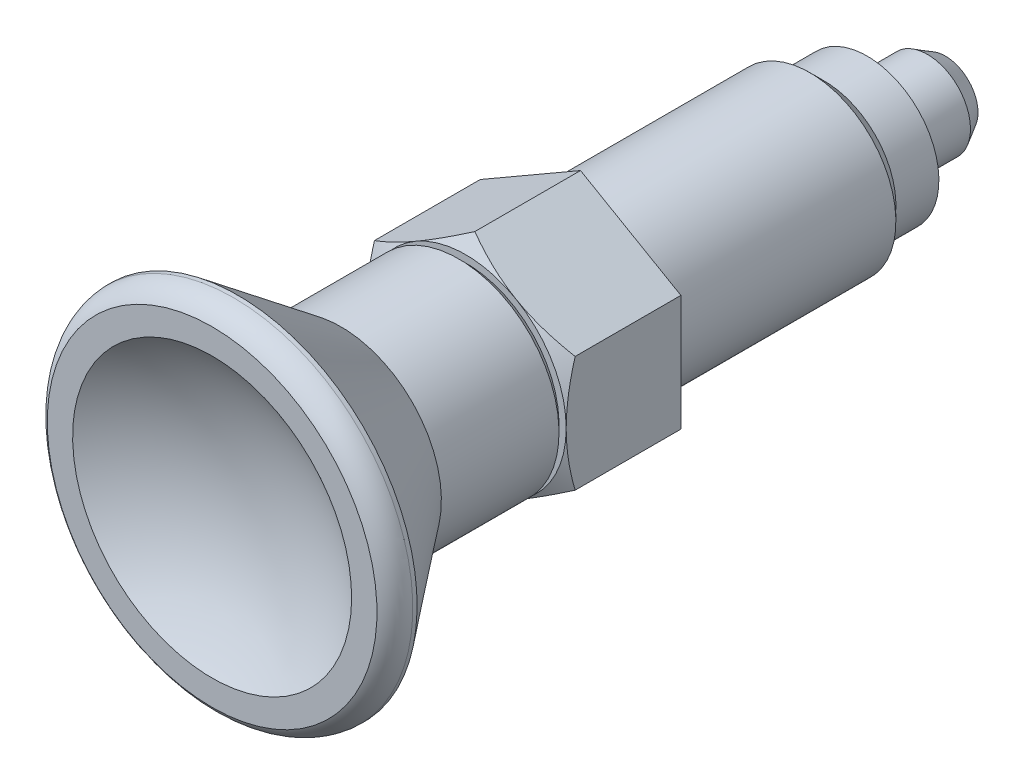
ISO-10303-21;
HEADER;
FILE_DESCRIPTION(('STEP AP214'),'2;1');
FILE_NAME('part.step','',(''),(''),'','','');
FILE_SCHEMA(('AUTOMOTIVE_DESIGN { 1 0 10303 214 1 1 1 1 }'));
ENDSEC;
DATA;
#1=APPLICATION_CONTEXT('core data for automotive mechanical design processes');
#2=APPLICATION_PROTOCOL_DEFINITION('international standard','automotive_design',2000,#1);
#3=PRODUCT_CONTEXT('',#1,'mechanical');
#4=PRODUCT('Part','Part','',(#3));
#5=PRODUCT_RELATED_PRODUCT_CATEGORY('part','',(#4));
#6=PRODUCT_DEFINITION_FORMATION('','',#4);
#7=PRODUCT_DEFINITION_CONTEXT('part definition',#1,'design');
#8=PRODUCT_DEFINITION('design','',#6,#7);
#9=PRODUCT_DEFINITION_SHAPE('','',#8);
#10=(LENGTH_UNIT() NAMED_UNIT(*) SI_UNIT(.MILLI.,.METRE.));
#11=(NAMED_UNIT(*) PLANE_ANGLE_UNIT() SI_UNIT($,.RADIAN.));
#12=(NAMED_UNIT(*) SI_UNIT($,.STERADIAN.) SOLID_ANGLE_UNIT());
#13=UNCERTAINTY_MEASURE_WITH_UNIT(LENGTH_MEASURE(1.E-05),#10,'distance_accuracy_value','');
#14=(GEOMETRIC_REPRESENTATION_CONTEXT(3) GLOBAL_UNCERTAINTY_ASSIGNED_CONTEXT((#13)) GLOBAL_UNIT_ASSIGNED_CONTEXT((#10,
#11,#12)) REPRESENTATION_CONTEXT('',''));
#15=CARTESIAN_POINT('',(0.,0.,0.));
#16=DIRECTION('',(0.,0.,1.));
#17=DIRECTION('',(1.,0.,0.));
#18=AXIS2_PLACEMENT_3D('',#15,#16,#17);
#19=CARTESIAN_POINT('',(0.,0.,38.4));
#20=DIRECTION('',(-1.,0.,0.));
#21=DIRECTION('',(0.,1.,0.));
#22=AXIS2_PLACEMENT_3D('',#19,#20,#21);
#23=SPHERICAL_SURFACE('',#22,16.);
#24=CARTESIAN_POINT('',(0.,9.73190628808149,25.7));
#25=CARTESIAN_POINT('',(-0.273421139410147,9.73190824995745,25.7));
#26=CARTESIAN_POINT('',(-0.546810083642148,9.72037876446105,25.7));
#27=CARTESIAN_POINT('',(-1.091736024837,9.67434130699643,25.7));
#28=CARTESIAN_POINT('',(-1.36327251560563,9.63982728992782,25.7));
#29=CARTESIAN_POINT('',(-1.90275798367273,9.54800856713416,25.7));
#30=CARTESIAN_POINT('',(-2.17070282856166,9.49067960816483,25.7));
#31=CARTESIAN_POINT('',(-2.70081243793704,9.35363887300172,25.7));
#32=CARTESIAN_POINT('',(-2.96297710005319,9.27392670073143,25.7));
#33=CARTESIAN_POINT('',(-3.4795258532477,9.09273210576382,25.7));
#34=CARTESIAN_POINT('',(-3.7339137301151,8.99126047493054,25.7));
#35=CARTESIAN_POINT('',(-4.23323988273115,8.76724349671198,25.7));
#36=CARTESIAN_POINT('',(-4.47817800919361,8.64469781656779,25.7));
#37=CARTESIAN_POINT('',(-4.95679945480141,8.37943799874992,25.7));
#38=CARTESIAN_POINT('',(-5.19048552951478,8.23672883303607,25.7));
#39=CARTESIAN_POINT('',(-5.64500156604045,7.93213690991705,25.7));
#40=CARTESIAN_POINT('',(-5.86583180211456,7.77025456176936,25.7));
#41=CARTESIAN_POINT('',(-6.29309658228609,7.42844474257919,25.7));
#42=CARTESIAN_POINT('',(-6.49952946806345,7.24851519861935,25.7));
#43=CARTESIAN_POINT('',(-6.89650428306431,6.87190546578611,25.7));
#44=CARTESIAN_POINT('',(-7.0870461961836,6.67522525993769,25.7));
#45=CARTESIAN_POINT('',(-7.45089134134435,6.2665046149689,25.7));
#46=CARTESIAN_POINT('',(-7.62419390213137,6.05446357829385,25.7));
#47=CARTESIAN_POINT('',(-7.95231974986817,5.61653562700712,25.7));
#48=CARTESIAN_POINT('',(-8.10714304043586,5.39064871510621,25.7));
#49=CARTESIAN_POINT('',(-8.39720695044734,4.92663927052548,25.7));
#50=CARTESIAN_POINT('',(-8.53244793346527,4.68851696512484,25.7));
#51=CARTESIAN_POINT('',(-8.78238916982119,4.20172578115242,25.7));
#52=CARTESIAN_POINT('',(-8.89708942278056,3.95305690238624,25.7));
#53=CARTESIAN_POINT('',(-9.10513353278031,3.4469409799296,25.7));
#54=CARTESIAN_POINT('',(-9.19847743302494,3.1894939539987,25.7));
#55=CARTESIAN_POINT('',(-9.3631455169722,2.66765155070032,25.7));
#56=CARTESIAN_POINT('',(-9.4344697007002,2.40325617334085,25.7));
#57=CARTESIAN_POINT('',(-9.55459139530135,1.86939624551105,25.7));
#58=CARTESIAN_POINT('',(-9.60338886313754,1.59993168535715,25.7));
#59=CARTESIAN_POINT('',(-9.67811000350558,1.05784961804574,25.7));
#60=CARTESIAN_POINT('',(-9.70403367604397,0.78523211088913,25.7));
#61=CARTESIAN_POINT('',(-9.7328228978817,0.238782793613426,25.7));
#62=CARTESIAN_POINT('',(-9.7356884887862,-0.03504901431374,25.7));
#63=CARTESIAN_POINT('',(-9.71834128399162,-0.581980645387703,25.7));
#64=CARTESIAN_POINT('',(-9.69812848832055,-0.855080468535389,25.7));
#65=CARTESIAN_POINT('',(-9.63476819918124,-1.39860665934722,25.7));
#66=CARTESIAN_POINT('',(-9.59162069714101,-1.66903302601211,25.7));
#67=CARTESIAN_POINT('',(-9.4826977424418,-2.20528963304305,25.7));
#68=CARTESIAN_POINT('',(-9.41692228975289,-2.47111987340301,25.7));
#69=CARTESIAN_POINT('',(-9.263210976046,-2.9962946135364,25.7));
#70=CARTESIAN_POINT('',(-9.17527509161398,-3.25563910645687,25.7));
#71=CARTESIAN_POINT('',(-8.97786812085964,-3.7659982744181,25.7));
#72=CARTESIAN_POINT('',(-8.86839703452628,-4.01701294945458,25.7));
#73=CARTESIAN_POINT('',(-8.62869797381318,-4.50892783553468,25.7));
#74=CARTESIAN_POINT('',(-8.49847000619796,-4.7498280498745,25.7));
#75=CARTESIAN_POINT('',(-8.2181830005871,-5.21980144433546,25.7));
#76=CARTESIAN_POINT('',(-8.06812396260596,-5.44887462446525,25.7));
#77=CARTESIAN_POINT('',(-7.74924171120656,-5.89356528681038,25.7));
#78=CARTESIAN_POINT('',(-7.58041850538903,-6.10918277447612,25.7));
#79=CARTESIAN_POINT('',(-7.22520810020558,-6.52542924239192,25.7));
#80=CARTESIAN_POINT('',(-7.0388209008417,-6.72605822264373,25.7));
#81=CARTESIAN_POINT('',(-6.64980758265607,-7.11090135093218,25.7));
#82=CARTESIAN_POINT('',(-6.44718146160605,-7.2951154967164,25.7));
#83=CARTESIAN_POINT('',(-6.02713087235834,-7.64581927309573,25.7));
#84=CARTESIAN_POINT('',(-5.80970640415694,-7.8123089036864,25.7));
#85=CARTESIAN_POINT('',(-5.36160484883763,-8.12638002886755,25.7));
#86=CARTESIAN_POINT('',(-5.13092775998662,-8.27396152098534,25.7));
#87=CARTESIAN_POINT('',(-4.65796096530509,-8.54916712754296,25.7));
#88=CARTESIAN_POINT('',(-4.41567125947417,-8.67679124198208,25.7));
#89=CARTESIAN_POINT('',(-3.92120177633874,-8.91117475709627,25.7));
#90=CARTESIAN_POINT('',(-3.66902199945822,-9.01793415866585,25.7));
#91=CARTESIAN_POINT('',(-3.15656521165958,-9.2098292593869,25.7));
#92=CARTESIAN_POINT('',(-2.89628820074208,-9.29496495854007,25.7));
#93=CARTESIAN_POINT('',(-2.36948737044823,-9.44300738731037,25.7));
#94=CARTESIAN_POINT('',(-2.10296355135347,-9.50591411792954,25.7));
#95=CARTESIAN_POINT('',(-1.56556391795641,-9.60905138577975,25.7));
#96=CARTESIAN_POINT('',(-1.29468810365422,-9.64928192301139,25.7));
#97=CARTESIAN_POINT('',(-0.750510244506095,-9.70678078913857,25.7));
#98=CARTESIAN_POINT('',(-0.477208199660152,-9.7240491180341,25.7));
#99=CARTESIAN_POINT('',(0.0698791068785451,-9.7355007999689,25.7));
#100=CARTESIAN_POINT('',(0.343664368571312,-9.72968415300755,25.7));
#101=CARTESIAN_POINT('',(0.88977167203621,-9.69500723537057,25.7));
#102=CARTESIAN_POINT('',(1.16209371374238,-9.66614696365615,25.7));
#103=CARTESIAN_POINT('',(1.70333851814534,-9.58558797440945,25.7));
#104=CARTESIAN_POINT('',(1.97226128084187,-9.53388925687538,25.7));
#105=CARTESIAN_POINT('',(2.5047956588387,-9.40802092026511,25.7));
#106=CARTESIAN_POINT('',(2.76840727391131,-9.33385130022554,25.7));
#107=CARTESIAN_POINT('',(3.28844522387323,-9.16356846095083,25.7));
#108=CARTESIAN_POINT('',(3.54487155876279,-9.06745524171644,25.7));
#109=CARTESIAN_POINT('',(4.04871587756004,-8.85396852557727,25.7));
#110=CARTESIAN_POINT('',(4.29613386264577,-8.73659503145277,25.7));
#111=CARTESIAN_POINT('',(4.78020252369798,-8.48142221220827,25.7));
#112=CARTESIAN_POINT('',(5.01685319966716,-8.34362288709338,25.7));
#113=CARTESIAN_POINT('',(5.47770476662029,-8.04857809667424,25.7));
#114=CARTESIAN_POINT('',(5.70190565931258,-7.89133263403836,25.7));
#115=CARTESIAN_POINT('',(6.13626376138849,-7.55851347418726,25.7));
#116=CARTESIAN_POINT('',(6.34642097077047,-7.38293977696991,25.7));
#117=CARTESIAN_POINT('',(6.75119769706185,-7.01471229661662,25.7));
#118=CARTESIAN_POINT('',(6.94581720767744,-6.82205850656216,25.7));
#119=CARTESIAN_POINT('',(7.31813481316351,-6.42104055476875,25.7));
#120=CARTESIAN_POINT('',(7.49583290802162,-6.21267639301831,25.7));
#121=CARTESIAN_POINT('',(7.83304440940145,-5.78171897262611,25.7));
#122=CARTESIAN_POINT('',(7.9925578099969,-5.55912570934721,25.7));
#123=CARTESIAN_POINT('',(8.29226580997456,-5.10129265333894,25.7));
#124=CARTESIAN_POINT('',(8.43246040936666,-4.86605286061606,25.7));
#125=CARTESIAN_POINT('',(8.69253396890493,-4.38459941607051,25.7));
#126=CARTESIAN_POINT('',(8.81241295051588,-4.13838577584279,25.7));
#127=CARTESIAN_POINT('',(9.03100318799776,-3.63673483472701,25.7));
#128=CARTESIAN_POINT('',(9.1297144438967,-3.38129753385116,25.7));
#129=CARTESIAN_POINT('',(9.3052674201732,-2.86301537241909,25.7));
#130=CARTESIAN_POINT('',(9.38210914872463,-2.60017051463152,25.7));
#131=CARTESIAN_POINT('',(9.51337682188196,-2.0689418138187,25.7));
#132=CARTESIAN_POINT('',(9.56780276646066,-1.80055797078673,25.7));
#133=CARTESIAN_POINT('',(9.65385201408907,-1.26015885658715,25.7));
#134=CARTESIAN_POINT('',(9.68547527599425,-0.988143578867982,25.7));
#135=CARTESIAN_POINT('',(9.72569417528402,-0.442415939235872,25.7));
#136=CARTESIAN_POINT('',(9.73428981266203,-0.168703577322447,25.7));
#137=CARTESIAN_POINT('',(9.72839235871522,0.378471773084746,25.7));
#138=CARTESIAN_POINT('',(9.7138993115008,0.651934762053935,25.7));
#139=CARTESIAN_POINT('',(9.66192760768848,1.19666773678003,25.7));
#140=CARTESIAN_POINT('',(9.62444895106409,1.4679377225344,25.7));
#141=CARTESIAN_POINT('',(9.52677237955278,2.00635667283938,25.7));
#142=CARTESIAN_POINT('',(9.46657441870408,2.27350562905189,25.7));
#143=CARTESIAN_POINT('',(9.32388721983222,2.80178267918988,25.7));
#144=CARTESIAN_POINT('',(9.24139798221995,3.06291077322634,25.7));
#145=CARTESIAN_POINT('',(9.05471294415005,3.5772944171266,25.7));
#146=CARTESIAN_POINT('',(8.95051674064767,3.83054982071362,25.7));
#147=CARTESIAN_POINT('',(8.72115947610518,4.32738249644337,25.7));
#148=CARTESIAN_POINT('',(8.59599841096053,4.57095976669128,25.7));
#149=CARTESIAN_POINT('',(8.32560656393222,5.04669509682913,25.7));
#150=CARTESIAN_POINT('',(8.18037656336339,5.27885360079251,25.7));
#151=CARTESIAN_POINT('',(7.8708757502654,5.73011089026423,25.7));
#152=CARTESIAN_POINT('',(7.70660495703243,5.94920968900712,25.7));
#153=CARTESIAN_POINT('',(7.36021019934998,6.37276584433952,25.7));
#154=CARTESIAN_POINT('',(7.17808828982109,6.57722488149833,25.7));
#155=CARTESIAN_POINT('',(6.79726585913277,6.97008025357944,25.7));
#156=CARTESIAN_POINT('',(6.59856498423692,7.15847624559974,25.7));
#157=CARTESIAN_POINT('',(6.18594941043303,7.51790585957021,25.7));
#158=CARTESIAN_POINT('',(5.97203097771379,7.68893519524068,25.7));
#159=CARTESIAN_POINT('',(5.53054854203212,8.01235979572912,25.7));
#160=CARTESIAN_POINT('',(5.30298475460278,8.16475535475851,25.7));
#161=CARTESIAN_POINT('',(4.8357105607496,8.44990255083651,25.7));
#162=CARTESIAN_POINT('',(4.59599419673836,8.58264442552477,25.7));
#163=CARTESIAN_POINT('',(4.10623086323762,8.82744687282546,25.7));
#164=CARTESIAN_POINT('',(3.85618407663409,8.93950781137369,25.7));
#165=CARTESIAN_POINT('',(3.34780095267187,9.14204631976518,25.7));
#166=CARTESIAN_POINT('',(3.089473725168,9.23254674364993,25.7));
#167=CARTESIAN_POINT('',(2.56620241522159,9.39145195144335,25.7));
#168=CARTESIAN_POINT('',(2.30126009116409,9.45986254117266,25.7));
#169=CARTESIAN_POINT('',(1.69995282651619,9.58836325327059,25.7));
#170=CARTESIAN_POINT('',(1.36222155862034,9.6421462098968,25.7));
#171=CARTESIAN_POINT('',(0.682976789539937,9.71391650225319,25.7));
#172=CARTESIAN_POINT('',(0.341463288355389,9.73190383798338,25.7));
#173=CARTESIAN_POINT('',(0.,9.73190628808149,25.7));
#174=B_SPLINE_CURVE_WITH_KNOTS('',3,(#24,#25,#26,#27,#28,#29,#30,#31,#32,#33,#34,#35,#36,#37,
#38,#39,#40,#41,#42,#43,#44,#45,#46,#47,#48,#49,#50,#51,#52,#53,#54,#55,#56,#57,#58,#59,#60,#61,
#62,#63,#64,#65,#66,#67,#68,#69,#70,#71,#72,#73,#74,#75,#76,#77,#78,#79,#80,#81,#82,#83,#84,#85,
#86,#87,#88,#89,#90,#91,#92,#93,#94,#95,#96,#97,#98,#99,#100,#101,#102,#103,#104,#105,#106,#107,
#108,#109,#110,#111,#112,#113,#114,#115,#116,#117,#118,#119,#120,#121,#122,#123,#124,#125,#126,
#127,#128,#129,#130,#131,#132,#133,#134,#135,#136,#137,#138,#139,#140,#141,#142,#143,#144,#145,
#146,#147,#148,#149,#150,#151,#152,#153,#154,#155,#156,#157,#158,#159,#160,#161,#162,#163,#164,
#165,#166,#167,#168,#169,#170,#171,#172,#173),.UNSPECIFIED.,.T.,.F.,(4,2,2,2,2,2,2,2,2,2,2,2,2,
2,2,2,2,2,2,2,2,2,2,2,2,2,2,2,2,2,2,2,2,2,2,2,2,2,2,2,2,2,2,2,2,2,2,2,2,2,2,2,2,2,2,2,2,2,2,2,2,
2,2,2,2,2,2,2,2,2,2,2,2,2,4),(0.,0.819965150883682,1.64014604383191,2.46120116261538,
3.28227081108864,4.10293417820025,4.92361050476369,5.74408481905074,6.56454162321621,
7.38509277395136,8.20564475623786,9.02622867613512,9.8468124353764,10.6673809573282,
11.4879494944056,12.3085163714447,13.1290832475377,13.9496516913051,14.7702201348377,
15.5907870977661,16.411354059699,17.2319213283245,18.0524885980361,18.8730567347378,
19.6936248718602,20.5141927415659,21.3347606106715,22.1553281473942,22.9758956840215,
23.7964633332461,24.6170309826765,25.4375987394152,26.2581664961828,27.0787342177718,
27.8993019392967,28.7198696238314,29.5404373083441,30.3610049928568,31.1815726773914,
32.0021403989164,32.8227081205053,33.6432758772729,34.4638436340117,35.284411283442,
36.1049789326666,36.9255464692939,37.7461140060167,38.5666818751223,39.3872497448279,
40.2078178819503,41.028386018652,41.8489532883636,42.6695205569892,43.4900875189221,
44.3106544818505,45.1312229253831,45.9517913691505,46.7723582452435,47.5929251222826,
48.41349365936,49.2340621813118,50.054645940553,50.8752298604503,51.6957818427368,
52.516332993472,53.3367897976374,54.1572641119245,54.9779404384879,55.7986038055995,
56.6196734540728,57.4407285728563,58.2609094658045,59.0808746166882,60.1048919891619,
61.1289093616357),.UNSPECIFIED.);
#175=CARTESIAN_POINT('',(0.,9.73190628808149,25.7));
#176=VERTEX_POINT('',#175);
#177=EDGE_CURVE('E19',#176,#176,#174,.T.);
#178=ORIENTED_EDGE('',*,*,#177,.T.);
#179=EDGE_LOOP('',(#178));
#180=FACE_BOUND('',#179,.T.);
#181=ADVANCED_FACE('F14',(#180),#23,.F.);
#182=CARTESIAN_POINT('',(9.73190628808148,0.,25.7));
#183=DIRECTION('',(0.,0.,-1.));
#184=DIRECTION('',(0.,1.,0.));
#185=AXIS2_PLACEMENT_3D('',#182,#183,#184);
#186=PLANE('',#185);
#187=ORIENTED_EDGE('',*,*,#177,.F.);
#188=EDGE_LOOP('',(#187));
#189=FACE_BOUND('',#188,.T.);
#190=CARTESIAN_POINT('',(0.,0.,25.7));
#191=DIRECTION('',(0.,0.,-1.));
#192=DIRECTION('',(0.,1.,0.));
#193=AXIS2_PLACEMENT_3D('',#190,#191,#192);
#194=CIRCLE('',#193,11.5);
#195=CARTESIAN_POINT('',(0.,11.5,25.7));
#196=VERTEX_POINT('',#195);
#197=EDGE_CURVE('E422',#196,#196,#194,.T.);
#198=ORIENTED_EDGE('',*,*,#197,.F.);
#199=EDGE_LOOP('',(#198));
#200=FACE_BOUND('',#199,.T.);
#201=ADVANCED_FACE('F357',(#189,#200),#186,.F.);
#202=CARTESIAN_POINT('',(0.,0.,-21.));
#203=DIRECTION('',(-1.,0.,0.));
#204=DIRECTION('',(0.,1.,0.));
#205=AXIS2_PLACEMENT_3D('',#202,#203,#204);
#206=SPHERICAL_SURFACE('',#205,5.00000000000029);
#207=CARTESIAN_POINT('',(0.,0.,-25.4510834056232));
#208=DIRECTION('',(0.,0.,1.));
#209=DIRECTION('',(0.,-1.,0.));
#210=AXIS2_PLACEMENT_3D('',#207,#208,#209);
#211=CIRCLE('',#210,2.27768665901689);
#212=CARTESIAN_POINT('',(0.,-2.27768665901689,-25.4510834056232));
#213=VERTEX_POINT('',#212);
#214=EDGE_CURVE('E341',#213,#213,#211,.T.);
#215=ORIENTED_EDGE('',*,*,#214,.F.);
#216=EDGE_LOOP('',(#215));
#217=FACE_BOUND('',#216,.T.);
#218=ADVANCED_FACE('F353',(#217),#206,.T.);
#219=CARTESIAN_POINT('',(0.,0.,23.9596620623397));
#220=DIRECTION('',(0.,0.,-1.));
#221=DIRECTION('',(0.,1.,0.));
#222=AXIS2_PLACEMENT_3D('',#219,#220,#221);
#223=TOROIDAL_SURFACE('',#222,10.5144930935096,2.);
#224=CARTESIAN_POINT('',(0.,0.,24.2));
#225=DIRECTION('',(0.,0.,1.));
#226=DIRECTION('',(0.,-1.,0.));
#227=AXIS2_PLACEMENT_3D('',#224,#225,#226);
#228=CIRCLE('',#227,12.5);
#229=CARTESIAN_POINT('',(0.,-12.5,24.2));
#230=VERTEX_POINT('',#229);
#231=EDGE_CURVE('E336',#230,#230,#228,.F.);
#232=ORIENTED_EDGE('',*,*,#231,.F.);
#233=EDGE_LOOP('',(#232));
#234=FACE_BOUND('',#233,.T.);
#235=ORIENTED_EDGE('',*,*,#197,.T.);
#236=EDGE_LOOP('',(#235));
#237=FACE_BOUND('',#236,.T.);
#238=ADVANCED_FACE('F348',(#234,#237),#223,.T.);
#239=CARTESIAN_POINT('',(0.,0.,-24.2000000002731));
#240=DIRECTION('',(0.,0.,1.));
#241=DIRECTION('',(0.,-1.,0.));
#242=AXIS2_PLACEMENT_3D('',#239,#240,#241);
#243=CONICAL_SURFACE('',#242,2.99999999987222,0.523598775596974);
#244=CARTESIAN_POINT('',(0.,0.,-24.2));
#245=DIRECTION('',(0.,0.,1.));
#246=DIRECTION('',(0.,-1.,0.));
#247=AXIS2_PLACEMENT_3D('',#244,#245,#246);
#248=CIRCLE('',#247,3.);
#249=CARTESIAN_POINT('',(0.,-3.,-24.2));
#250=VERTEX_POINT('',#249);
#251=EDGE_CURVE('E331',#250,#250,#248,.T.);
#252=ORIENTED_EDGE('',*,*,#251,.F.);
#253=EDGE_LOOP('',(#252));
#254=FACE_BOUND('',#253,.T.);
#255=ORIENTED_EDGE('',*,*,#214,.T.);
#256=EDGE_LOOP('',(#255));
#257=FACE_BOUND('',#256,.T.);
#258=ADVANCED_FACE('F352',(#254,#257),#243,.T.);
#259=CARTESIAN_POINT('',(0.,0.,-26.));
#260=DIRECTION('',(0.,0.,1.));
#261=DIRECTION('',(0.,-1.,0.));
#262=AXIS2_PLACEMENT_3D('',#259,#260,#261);
#263=CYLINDRICAL_SURFACE('',#262,12.5);
#264=ORIENTED_EDGE('',*,*,#231,.T.);
#265=EDGE_LOOP('',(#264));
#266=FACE_BOUND('',#265,.T.);
#267=CARTESIAN_POINT('',(0.,0.,23.9));
#268=DIRECTION('',(0.,0.,1.));
#269=DIRECTION('',(0.,-1.,0.));
#270=AXIS2_PLACEMENT_3D('',#267,#268,#269);
#271=CIRCLE('',#270,12.5);
#272=CARTESIAN_POINT('',(0.,-12.5,23.9));
#273=VERTEX_POINT('',#272);
#274=EDGE_CURVE('E318',#273,#273,#271,.F.);
#275=ORIENTED_EDGE('',*,*,#274,.F.);
#276=EDGE_LOOP('',(#275));
#277=FACE_BOUND('',#276,.T.);
#278=ADVANCED_FACE('F430',(#266,#277),#263,.T.);
#279=CARTESIAN_POINT('',(0.,0.,-26.));
#280=DIRECTION('',(0.,0.,1.));
#281=DIRECTION('',(0.,-1.,0.));
#282=AXIS2_PLACEMENT_3D('',#279,#280,#281);
#283=CYLINDRICAL_SURFACE('',#282,3.);
#284=CARTESIAN_POINT('',(0.,0.,-20.3732050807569));
#285=DIRECTION('',(0.,0.,-1.));
#286=DIRECTION('',(0.,1.,0.));
#287=AXIS2_PLACEMENT_3D('',#284,#285,#286);
#288=CIRCLE('',#287,3.);
#289=CARTESIAN_POINT('',(0.,3.,-20.3732050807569));
#290=VERTEX_POINT('',#289);
#291=EDGE_CURVE('E315',#290,#290,#288,.T.);
#292=ORIENTED_EDGE('',*,*,#291,.T.);
#293=EDGE_LOOP('',(#292));
#294=FACE_BOUND('',#293,.T.);
#295=ORIENTED_EDGE('',*,*,#251,.T.);
#296=EDGE_LOOP('',(#295));
#297=FACE_BOUND('',#296,.T.);
#298=ADVANCED_FACE('F435',(#294,#297),#283,.T.);
#299=CARTESIAN_POINT('',(0.,0.,23.9));
#300=DIRECTION('',(0.,0.,1.));
#301=DIRECTION('',(0.,-1.,0.));
#302=AXIS2_PLACEMENT_3D('',#299,#300,#301);
#303=CONICAL_SURFACE('',#302,12.5,0.65275314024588);
#304=ORIENTED_EDGE('',*,*,#274,.T.);
#305=EDGE_LOOP('',(#304));
#306=FACE_BOUND('',#305,.T.);
#307=CARTESIAN_POINT('',(0.,0.,16.7062986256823));
#308=DIRECTION('',(0.,0.,1.));
#309=DIRECTION('',(0.,-1.,0.));
#310=AXIS2_PLACEMENT_3D('',#307,#308,#309);
#311=CIRCLE('',#310,7.);
#312=CARTESIAN_POINT('',(0.,-7.,16.7062986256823));
#313=VERTEX_POINT('',#312);
#314=EDGE_CURVE('E284',#313,#313,#311,.F.);
#315=ORIENTED_EDGE('',*,*,#314,.F.);
#316=EDGE_LOOP('',(#315));
#317=FACE_BOUND('',#316,.T.);
#318=ADVANCED_FACE('F308',(#306,#317),#303,.T.);
#319=CARTESIAN_POINT('',(0.,0.,-20.2));
#320=DIRECTION('',(0.,0.,-1.));
#321=DIRECTION('',(0.,1.,0.));
#322=AXIS2_PLACEMENT_3D('',#319,#320,#321);
#323=TOROIDAL_SURFACE('',#322,3.1,0.2);
#324=CARTESIAN_POINT('',(0.,0.,-20.));
#325=DIRECTION('',(0.,0.,-1.));
#326=DIRECTION('',(0.,1.,0.));
#327=AXIS2_PLACEMENT_3D('',#324,#325,#326);
#328=CIRCLE('',#327,3.1);
#329=CARTESIAN_POINT('',(0.,3.1,-20.));
#330=VERTEX_POINT('',#329);
#331=EDGE_CURVE('E273',#330,#330,#328,.T.);
#332=ORIENTED_EDGE('',*,*,#331,.T.);
#333=EDGE_LOOP('',(#332));
#334=FACE_BOUND('',#333,.T.);
#335=ORIENTED_EDGE('',*,*,#291,.F.);
#336=EDGE_LOOP('',(#335));
#337=FACE_BOUND('',#336,.T.);
#338=ADVANCED_FACE('F302',(#334,#337),#323,.F.);
#339=CARTESIAN_POINT('',(0.,0.,-26.));
#340=DIRECTION('',(0.,0.,1.));
#341=DIRECTION('',(0.,-1.,0.));
#342=AXIS2_PLACEMENT_3D('',#339,#340,#341);
#343=CYLINDRICAL_SURFACE('',#342,7.);
#344=ORIENTED_EDGE('',*,*,#314,.T.);
#345=EDGE_LOOP('',(#344));
#346=FACE_BOUND('',#345,.T.);
#347=CARTESIAN_POINT('',(0.,0.,8.5));
#348=DIRECTION('',(0.,0.,1.));
#349=DIRECTION('',(0.,-1.,0.));
#350=AXIS2_PLACEMENT_3D('',#347,#348,#349);
#351=CIRCLE('',#350,7.);
#352=CARTESIAN_POINT('',(0.,-7.,8.5));
#353=VERTEX_POINT('',#352);
#354=EDGE_CURVE('E269',#353,#353,#351,.F.);
#355=ORIENTED_EDGE('',*,*,#354,.F.);
#356=EDGE_LOOP('',(#355));
#357=FACE_BOUND('',#356,.T.);
#358=ADVANCED_FACE('F297',(#346,#357),#343,.T.);
#359=CARTESIAN_POINT('',(3.95,0.,-20.));
#360=DIRECTION('',(0.,0.,1.));
#361=DIRECTION('',(0.,-1.,0.));
#362=AXIS2_PLACEMENT_3D('',#359,#360,#361);
#363=PLANE('',#362);
#364=CARTESIAN_POINT('',(0.,0.,-19.9999999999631));
#365=DIRECTION('',(0.,0.,1.));
#366=DIRECTION('',(0.,-1.,0.));
#367=AXIS2_PLACEMENT_3D('',#364,#365,#366);
#368=CIRCLE('',#367,3.95000000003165);
#369=CARTESIAN_POINT('',(0.,-3.95000000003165,-19.9999999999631));
#370=VERTEX_POINT('',#369);
#371=EDGE_CURVE('E272',#370,#370,#368,.T.);
#372=ORIENTED_EDGE('',*,*,#371,.F.);
#373=EDGE_LOOP('',(#372));
#374=FACE_BOUND('',#373,.T.);
#375=ORIENTED_EDGE('',*,*,#331,.F.);
#376=EDGE_LOOP('',(#375));
#377=FACE_BOUND('',#376,.T.);
#378=ADVANCED_FACE('F286',(#374,#377),#363,.F.);
#379=CARTESIAN_POINT('',(0.,0.,8.5));
#380=DIRECTION('',(0.,0.,1.));
#381=DIRECTION('',(0.,-1.,0.));
#382=AXIS2_PLACEMENT_3D('',#379,#380,#381);
#383=CONICAL_SURFACE('',#382,7.,0.785398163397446);
#384=ORIENTED_EDGE('',*,*,#354,.T.);
#385=EDGE_LOOP('',(#384));
#386=FACE_BOUND('',#385,.T.);
#387=CARTESIAN_POINT('',(0.,0.,8.));
#388=DIRECTION('',(0.,0.,1.));
#389=DIRECTION('',(0.,-1.,0.));
#390=AXIS2_PLACEMENT_3D('',#387,#388,#389);
#391=CIRCLE('',#390,6.5);
#392=CARTESIAN_POINT('',(0.,-6.5,8.));
#393=VERTEX_POINT('',#392);
#394=EDGE_CURVE('E266',#393,#393,#391,.F.);
#395=ORIENTED_EDGE('',*,*,#394,.F.);
#396=EDGE_LOOP('',(#395));
#397=FACE_BOUND('',#396,.T.);
#398=ADVANCED_FACE('F296',(#386,#397),#383,.T.);
#399=CARTESIAN_POINT('',(0.,0.,-19.7000000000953));
#400=DIRECTION('',(0.,0.,1.));
#401=DIRECTION('',(0.,-1.,0.));
#402=AXIS2_PLACEMENT_3D('',#399,#400,#401);
#403=CONICAL_SURFACE('',#402,4.24999999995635,0.785398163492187);
#404=CARTESIAN_POINT('',(0.,0.,-19.7));
#405=DIRECTION('',(0.,0.,1.));
#406=DIRECTION('',(0.,-1.,0.));
#407=AXIS2_PLACEMENT_3D('',#404,#405,#406);
#408=CIRCLE('',#407,4.25);
#409=CARTESIAN_POINT('',(0.,-4.25,-19.7));
#410=VERTEX_POINT('',#409);
#411=EDGE_CURVE('E99',#410,#410,#408,.F.);
#412=ORIENTED_EDGE('',*,*,#411,.T.);
#413=EDGE_LOOP('',(#412));
#414=FACE_BOUND('',#413,.T.);
#415=ORIENTED_EDGE('',*,*,#371,.T.);
#416=EDGE_LOOP('',(#415));
#417=FACE_BOUND('',#416,.T.);
#418=ADVANCED_FACE('F458',(#414,#417),#403,.T.);
#419=CARTESIAN_POINT('',(7.,0.,8.));
#420=DIRECTION('',(0.,0.,1.));
#421=DIRECTION('',(0.,-1.,0.));
#422=AXIS2_PLACEMENT_3D('',#419,#420,#421);
#423=PLANE('',#422);
#424=CARTESIAN_POINT('',(0.,0.,8.));
#425=DIRECTION('',(0.,0.,-1.));
#426=DIRECTION('',(0.,1.,0.));
#427=AXIS2_PLACEMENT_3D('',#424,#425,#426);
#428=CIRCLE('',#427,7.);
#429=CARTESIAN_POINT('',(-3.5,-6.06217782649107,8.));
#430=VERTEX_POINT('',#429);
#431=CARTESIAN_POINT('',(-7.,0.,8.));
#432=VERTEX_POINT('',#431);
#433=EDGE_CURVE('E394',#430,#432,#428,.T.);
#434=ORIENTED_EDGE('',*,*,#433,.F.);
#435=CARTESIAN_POINT('',(0.,0.,8.));
#436=DIRECTION('',(0.,0.,-1.));
#437=DIRECTION('',(0.,1.,0.));
#438=AXIS2_PLACEMENT_3D('',#435,#436,#437);
#439=CIRCLE('',#438,7.);
#440=CARTESIAN_POINT('',(3.5,-6.06217782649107,8.));
#441=VERTEX_POINT('',#440);
#442=EDGE_CURVE('E397',#441,#430,#439,.T.);
#443=ORIENTED_EDGE('',*,*,#442,.F.);
#444=CARTESIAN_POINT('',(0.,0.,8.));
#445=DIRECTION('',(0.,0.,-1.));
#446=DIRECTION('',(0.,1.,0.));
#447=AXIS2_PLACEMENT_3D('',#444,#445,#446);
#448=CIRCLE('',#447,7.);
#449=CARTESIAN_POINT('',(7.,0.,8.));
#450=VERTEX_POINT('',#449);
#451=EDGE_CURVE('E94',#450,#441,#448,.T.);
#452=ORIENTED_EDGE('',*,*,#451,.F.);
#453=CARTESIAN_POINT('',(0.,0.,8.));
#454=DIRECTION('',(0.,0.,-1.));
#455=DIRECTION('',(0.,1.,0.));
#456=AXIS2_PLACEMENT_3D('',#453,#454,#455);
#457=CIRCLE('',#456,7.);
#458=CARTESIAN_POINT('',(3.5,6.06217782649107,8.));
#459=VERTEX_POINT('',#458);
#460=EDGE_CURVE('E87',#459,#450,#457,.T.);
#461=ORIENTED_EDGE('',*,*,#460,.F.);
#462=CARTESIAN_POINT('',(0.,0.,8.));
#463=DIRECTION('',(0.,0.,-1.));
#464=DIRECTION('',(0.,1.,0.));
#465=AXIS2_PLACEMENT_3D('',#462,#463,#464);
#466=CIRCLE('',#465,7.);
#467=CARTESIAN_POINT('',(-3.5,6.06217782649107,8.));
#468=VERTEX_POINT('',#467);
#469=EDGE_CURVE('E91',#468,#459,#466,.T.);
#470=ORIENTED_EDGE('',*,*,#469,.F.);
#471=CARTESIAN_POINT('',(0.,0.,8.));
#472=DIRECTION('',(0.,0.,-1.));
#473=DIRECTION('',(0.,1.,0.));
#474=AXIS2_PLACEMENT_3D('',#471,#472,#473);
#475=CIRCLE('',#474,7.);
#476=EDGE_CURVE('E111',#432,#468,#475,.T.);
#477=ORIENTED_EDGE('',*,*,#476,.F.);
#478=EDGE_LOOP('',(#434,#443,#452,#461,#470,#477));
#479=FACE_BOUND('',#478,.T.);
#480=ORIENTED_EDGE('',*,*,#394,.T.);
#481=EDGE_LOOP('',(#480));
#482=FACE_BOUND('',#481,.T.);
#483=ADVANCED_FACE('F89',(#479,#482),#423,.T.);
#484=CARTESIAN_POINT('',(0.,0.,-20.));
#485=DIRECTION('',(0.,0.,1.));
#486=DIRECTION('',(0.,-1.,0.));
#487=AXIS2_PLACEMENT_3D('',#484,#485,#486);
#488=CYLINDRICAL_SURFACE('',#487,4.25);
#489=ORIENTED_EDGE('',*,*,#411,.F.);
#490=EDGE_LOOP('',(#489));
#491=FACE_BOUND('',#490,.T.);
#492=CARTESIAN_POINT('',(0.,0.,-20.));
#493=DIRECTION('',(0.,0.,1.));
#494=DIRECTION('',(0.,-1.,0.));
#495=AXIS2_PLACEMENT_3D('',#492,#493,#494);
#496=CIRCLE('',#495,4.25);
#497=CARTESIAN_POINT('',(0.,-4.25,-20.));
#498=VERTEX_POINT('',#497);
#499=EDGE_CURVE('E110',#498,#498,#496,.T.);
#500=ORIENTED_EDGE('',*,*,#499,.F.);
#501=EDGE_LOOP('',(#500));
#502=FACE_BOUND('',#501,.T.);
#503=ADVANCED_FACE('F461',(#491,#502),#488,.F.);
#504=CARTESIAN_POINT('',(0.,0.,7.37103392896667));
#505=DIRECTION('',(0.,0.,-1.));
#506=DIRECTION('',(0.,1.,0.));
#507=AXIS2_PLACEMENT_3D('',#504,#505,#506);
#508=CONICAL_SURFACE('',#507,8.08940119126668,1.0471975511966);
#509=CARTESIAN_POINT('',(7.,4.04145188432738,7.3747852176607));
#510=CARTESIAN_POINT('',(7.,3.7124794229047,7.46977521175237));
#511=CARTESIAN_POINT('',(7.,3.38087243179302,7.55680263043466));
#512=CARTESIAN_POINT('',(7.,2.7147353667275,7.71027391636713));
#513=CARTESIAN_POINT('',(7.,2.38022852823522,7.77681956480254));
#514=CARTESIAN_POINT('',(7.,1.87531133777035,7.85852632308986));
#515=CARTESIAN_POINT('',(7.,1.70636778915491,7.88275320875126));
#516=CARTESIAN_POINT('',(7.,1.36767189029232,7.92469045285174));
#517=CARTESIAN_POINT('',(7.,1.19791956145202,7.94240098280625));
#518=CARTESIAN_POINT('',(7.,0.856978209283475,7.97099434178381));
#519=CARTESIAN_POINT('',(7.,0.685786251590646,7.98184244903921));
#520=CARTESIAN_POINT('',(7.,0.343065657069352,7.99636029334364));
#521=CARTESIAN_POINT('',(7.,0.171536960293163,8.00002860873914));
#522=CARTESIAN_POINT('',(7.,0.,8.));
#523=B_SPLINE_CURVE_WITH_KNOTS('',3,(#509,#510,#511,#512,#513,#514,#515,#516,#517,#518,#519,
#520,#521,#522),.UNSPECIFIED.,.F.,.F.,(4,2,2,2,2,2,4),(0.,1.02765132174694,2.05011020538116,
2.56201048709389,3.07389729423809,3.58835380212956,4.10291216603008),.UNSPECIFIED.);
#524=CARTESIAN_POINT('',(7.,4.04145188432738,7.3747852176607));
#525=VERTEX_POINT('',#524);
#526=EDGE_CURVE('E116',#525,#450,#523,.T.);
#527=ORIENTED_EDGE('',*,*,#526,.F.);
#528=CARTESIAN_POINT('',(3.5,6.06217782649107,8.));
#529=CARTESIAN_POINT('',(3.64855536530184,5.97640934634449,8.00002860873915));
#530=CARTESIAN_POINT('',(3.79710357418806,5.89064499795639,7.99636029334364));
#531=CARTESIAN_POINT('',(4.09390831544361,5.71928470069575,7.98184244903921));
#532=CARTESIAN_POINT('',(4.24216489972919,5.63368872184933,7.97099434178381));
#533=CARTESIAN_POINT('',(4.53742877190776,5.46321804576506,7.94240098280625));
#534=CARTESIAN_POINT('',(4.68443860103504,5.37834188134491,7.92469045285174));
#535=CARTESIAN_POINT('',(4.97775785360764,5.20899393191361,7.88275320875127));
#536=CARTESIAN_POINT('',(5.1240672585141,5.12452215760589,7.85852632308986));
#537=CARTESIAN_POINT('',(5.56133837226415,4.87206356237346,7.77681956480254));
#538=CARTESIAN_POINT('',(5.85102979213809,4.70481014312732,7.71027391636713));
#539=CARTESIAN_POINT('',(6.42792141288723,4.37174161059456,7.55680263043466));
#540=CARTESIAN_POINT('',(6.71510149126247,4.20593811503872,7.46977521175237));
#541=CARTESIAN_POINT('',(7.,4.04145188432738,7.3747852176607));
#542=B_SPLINE_CURVE_WITH_KNOTS('',3,(#528,#529,#530,#531,#532,#533,#534,#535,#536,#537,#538,
#539,#540,#541),.UNSPECIFIED.,.F.,.F.,(4,2,2,2,2,2,4),(0.,0.514558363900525,1.02901487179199,
1.54090167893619,2.05280196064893,3.07526084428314,4.10291216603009),.UNSPECIFIED.);
#543=EDGE_CURVE('E113',#459,#525,#542,.T.);
#544=ORIENTED_EDGE('',*,*,#543,.F.);
#545=ORIENTED_EDGE('',*,*,#460,.T.);
#546=EDGE_LOOP('',(#527,#544,#545));
#547=FACE_BOUND('',#546,.T.);
#548=ADVANCED_FACE('F114',(#547),#508,.T.);
#549=CARTESIAN_POINT('',(0.,0.,7.37103392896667));
#550=DIRECTION('',(0.,0.,-1.));
#551=DIRECTION('',(0.,1.,0.));
#552=AXIS2_PLACEMENT_3D('',#549,#550,#551);
#553=CONICAL_SURFACE('',#552,8.08940119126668,1.0471975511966);
#554=CARTESIAN_POINT('',(7.,0.,8.));
#555=CARTESIAN_POINT('',(7.,-0.171536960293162,8.00002860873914));
#556=CARTESIAN_POINT('',(7.,-0.343065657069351,7.99636029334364));
#557=CARTESIAN_POINT('',(7.,-0.685786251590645,7.98184244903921));
#558=CARTESIAN_POINT('',(7.,-0.856978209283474,7.97099434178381));
#559=CARTESIAN_POINT('',(7.,-1.19791956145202,7.94240098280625));
#560=CARTESIAN_POINT('',(7.,-1.36767189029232,7.92469045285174));
#561=CARTESIAN_POINT('',(7.,-1.70636778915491,7.88275320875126));
#562=CARTESIAN_POINT('',(7.,-1.87531133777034,7.85852632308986));
#563=CARTESIAN_POINT('',(7.,-2.38022852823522,7.77681956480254));
#564=CARTESIAN_POINT('',(7.,-2.7147353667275,7.71027391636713));
#565=CARTESIAN_POINT('',(7.,-3.38087243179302,7.55680263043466));
#566=CARTESIAN_POINT('',(7.,-3.7124794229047,7.46977521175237));
#567=CARTESIAN_POINT('',(7.,-4.04145188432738,7.3747852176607));
#568=B_SPLINE_CURVE_WITH_KNOTS('',3,(#554,#555,#556,#557,#558,#559,#560,#561,#562,#563,#564,
#565,#566,#567),.UNSPECIFIED.,.F.,.F.,(4,2,2,2,2,2,4),(0.,0.514558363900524,1.02901487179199,
1.54090167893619,2.05280196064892,3.07526084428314,4.10291216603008),.UNSPECIFIED.);
#569=CARTESIAN_POINT('',(7.,-4.04145188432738,7.3747852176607));
#570=VERTEX_POINT('',#569);
#571=EDGE_CURVE('E243',#450,#570,#568,.T.);
#572=ORIENTED_EDGE('',*,*,#571,.F.);
#573=ORIENTED_EDGE('',*,*,#451,.T.);
#574=CARTESIAN_POINT('',(7.,-4.04145188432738,7.3747852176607));
#575=CARTESIAN_POINT('',(6.71510149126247,-4.20593811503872,7.46977521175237));
#576=CARTESIAN_POINT('',(6.42792141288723,-4.37174161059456,7.55680263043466));
#577=CARTESIAN_POINT('',(5.85102979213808,-4.70481014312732,7.71027391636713));
#578=CARTESIAN_POINT('',(5.56133837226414,-4.87206356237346,7.77681956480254));
#579=CARTESIAN_POINT('',(5.1240672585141,-5.1245221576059,7.85852632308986));
#580=CARTESIAN_POINT('',(4.97775785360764,-5.20899393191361,7.88275320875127));
#581=CARTESIAN_POINT('',(4.68443860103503,-5.37834188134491,7.92469045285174));
#582=CARTESIAN_POINT('',(4.53742877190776,-5.46321804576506,7.94240098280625));
#583=CARTESIAN_POINT('',(4.24216489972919,-5.63368872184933,7.97099434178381));
#584=CARTESIAN_POINT('',(4.0939083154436,-5.71928470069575,7.98184244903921));
#585=CARTESIAN_POINT('',(3.79710357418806,-5.89064499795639,7.99636029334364));
#586=CARTESIAN_POINT('',(3.64855536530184,-5.97640934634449,8.00002860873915));
#587=CARTESIAN_POINT('',(3.5,-6.06217782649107,8.));
#588=B_SPLINE_CURVE_WITH_KNOTS('',3,(#574,#575,#576,#577,#578,#579,#580,#581,#582,#583,#584,
#585,#586,#587),.UNSPECIFIED.,.F.,.F.,(4,2,2,2,2,2,4),(0.,1.02765132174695,2.05011020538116,
2.5620104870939,3.07389729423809,3.58835380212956,4.10291216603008),.UNSPECIFIED.);
#589=EDGE_CURVE('E236',#570,#441,#588,.T.);
#590=ORIENTED_EDGE('',*,*,#589,.F.);
#591=EDGE_LOOP('',(#572,#573,#590));
#592=FACE_BOUND('',#591,.T.);
#593=ADVANCED_FACE('F213',(#592),#553,.T.);
#594=CARTESIAN_POINT('',(0.,0.,7.37103392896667));
#595=DIRECTION('',(0.,0.,-1.));
#596=DIRECTION('',(0.,1.,0.));
#597=AXIS2_PLACEMENT_3D('',#594,#595,#596);
#598=CONICAL_SURFACE('',#597,8.08940119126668,1.0471975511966);
#599=CARTESIAN_POINT('',(3.5,-6.06217782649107,8.));
#600=CARTESIAN_POINT('',(3.35144463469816,-6.14794630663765,8.00002860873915));
#601=CARTESIAN_POINT('',(3.20289642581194,-6.23371065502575,7.99636029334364));
#602=CARTESIAN_POINT('',(2.90609168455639,-6.40507095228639,7.98184244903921));
#603=CARTESIAN_POINT('',(2.75783510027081,-6.49066693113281,7.97099434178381));
#604=CARTESIAN_POINT('',(2.46257122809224,-6.66113760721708,7.94240098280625));
#605=CARTESIAN_POINT('',(2.31556139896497,-6.74601377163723,7.92469045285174));
#606=CARTESIAN_POINT('',(2.02224214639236,-6.91536172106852,7.88275320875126));
#607=CARTESIAN_POINT('',(1.8759327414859,-6.99983349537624,7.85852632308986));
#608=CARTESIAN_POINT('',(1.43866162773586,-7.25229209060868,7.77681956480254));
#609=CARTESIAN_POINT('',(1.14897020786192,-7.41954550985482,7.71027391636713));
#610=CARTESIAN_POINT('',(0.572078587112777,-7.75261404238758,7.55680263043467));
#611=CARTESIAN_POINT('',(0.284898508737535,-7.91841753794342,7.46977521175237));
#612=CARTESIAN_POINT('',(0.,-8.08290376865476,7.3747852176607));
#613=B_SPLINE_CURVE_WITH_KNOTS('',3,(#599,#600,#601,#602,#603,#604,#605,#606,#607,#608,#609,
#610,#611,#612),.UNSPECIFIED.,.F.,.F.,(4,2,2,2,2,2,4),(0.,0.514558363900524,1.02901487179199,
1.54090167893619,2.05280196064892,3.07526084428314,4.10291216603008),.UNSPECIFIED.);
#614=CARTESIAN_POINT('',(0.,-8.08290376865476,7.3747852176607));
#615=VERTEX_POINT('',#614);
#616=EDGE_CURVE('E218',#441,#615,#613,.T.);
#617=ORIENTED_EDGE('',*,*,#616,.F.);
#618=ORIENTED_EDGE('',*,*,#442,.T.);
#619=CARTESIAN_POINT('',(0.,-8.08290376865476,7.3747852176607));
#620=CARTESIAN_POINT('',(-0.284898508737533,-7.91841753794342,7.46977521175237));
#621=CARTESIAN_POINT('',(-0.572078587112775,-7.75261404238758,7.55680263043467));
#622=CARTESIAN_POINT('',(-1.14897020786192,-7.41954550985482,7.71027391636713));
#623=CARTESIAN_POINT('',(-1.43866162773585,-7.25229209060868,7.77681956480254));
#624=CARTESIAN_POINT('',(-1.8759327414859,-6.99983349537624,7.85852632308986));
#625=CARTESIAN_POINT('',(-2.02224214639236,-6.91536172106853,7.88275320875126));
#626=CARTESIAN_POINT('',(-2.31556139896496,-6.74601377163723,7.92469045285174));
#627=CARTESIAN_POINT('',(-2.46257122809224,-6.66113760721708,7.94240098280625));
#628=CARTESIAN_POINT('',(-2.75783510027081,-6.49066693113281,7.97099434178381));
#629=CARTESIAN_POINT('',(-2.90609168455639,-6.40507095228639,7.98184244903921));
#630=CARTESIAN_POINT('',(-3.20289642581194,-6.23371065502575,7.99636029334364));
#631=CARTESIAN_POINT('',(-3.35144463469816,-6.14794630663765,8.00002860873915));
#632=CARTESIAN_POINT('',(-3.5,-6.06217782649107,8.));
#633=B_SPLINE_CURVE_WITH_KNOTS('',3,(#619,#620,#621,#622,#623,#624,#625,#626,#627,#628,#629,
#630,#631,#632),.UNSPECIFIED.,.F.,.F.,(4,2,2,2,2,2,4),(0.,1.02765132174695,2.05011020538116,
2.5620104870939,3.07389729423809,3.58835380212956,4.10291216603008),.UNSPECIFIED.);
#634=EDGE_CURVE('E224',#615,#430,#633,.T.);
#635=ORIENTED_EDGE('',*,*,#634,.F.);
#636=EDGE_LOOP('',(#617,#618,#635));
#637=FACE_BOUND('',#636,.T.);
#638=ADVANCED_FACE('F207',(#637),#598,.T.);
#639=CARTESIAN_POINT('',(0.,0.,7.37103392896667));
#640=DIRECTION('',(0.,0.,-1.));
#641=DIRECTION('',(0.,1.,0.));
#642=AXIS2_PLACEMENT_3D('',#639,#640,#641);
#643=CONICAL_SURFACE('',#642,8.08940119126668,1.0471975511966);
#644=CARTESIAN_POINT('',(-3.5,-6.06217782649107,8.));
#645=CARTESIAN_POINT('',(-3.64855536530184,-5.97640934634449,8.00002860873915));
#646=CARTESIAN_POINT('',(-3.79710357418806,-5.89064499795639,7.99636029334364));
#647=CARTESIAN_POINT('',(-4.09390831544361,-5.71928470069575,7.98184244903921));
#648=CARTESIAN_POINT('',(-4.24216489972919,-5.63368872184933,7.97099434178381));
#649=CARTESIAN_POINT('',(-4.53742877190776,-5.46321804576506,7.94240098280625));
#650=CARTESIAN_POINT('',(-4.68443860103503,-5.37834188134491,7.92469045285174));
#651=CARTESIAN_POINT('',(-4.97775785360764,-5.20899393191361,7.88275320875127));
#652=CARTESIAN_POINT('',(-5.1240672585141,-5.1245221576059,7.85852632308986));
#653=CARTESIAN_POINT('',(-5.56133837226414,-4.87206356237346,7.77681956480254));
#654=CARTESIAN_POINT('',(-5.85102979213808,-4.70481014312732,7.71027391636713));
#655=CARTESIAN_POINT('',(-6.42792141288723,-4.37174161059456,7.55680263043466));
#656=CARTESIAN_POINT('',(-6.71510149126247,-4.20593811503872,7.46977521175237));
#657=CARTESIAN_POINT('',(-7.,-4.04145188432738,7.3747852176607));
#658=B_SPLINE_CURVE_WITH_KNOTS('',3,(#644,#645,#646,#647,#648,#649,#650,#651,#652,#653,#654,
#655,#656,#657),.UNSPECIFIED.,.F.,.F.,(4,2,2,2,2,2,4),(0.,0.514558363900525,1.02901487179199,
1.54090167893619,2.05280196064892,3.07526084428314,4.10291216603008),.UNSPECIFIED.);
#659=CARTESIAN_POINT('',(-7.,-4.04145188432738,7.3747852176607));
#660=VERTEX_POINT('',#659);
#661=EDGE_CURVE('E197',#430,#660,#658,.T.);
#662=ORIENTED_EDGE('',*,*,#661,.F.);
#663=ORIENTED_EDGE('',*,*,#433,.T.);
#664=CARTESIAN_POINT('',(-7.,-4.04145188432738,7.3747852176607));
#665=CARTESIAN_POINT('',(-7.,-3.7124794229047,7.46977521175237));
#666=CARTESIAN_POINT('',(-7.,-3.38087243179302,7.55680263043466));
#667=CARTESIAN_POINT('',(-7.,-2.7147353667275,7.71027391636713));
#668=CARTESIAN_POINT('',(-7.,-2.38022852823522,7.77681956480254));
#669=CARTESIAN_POINT('',(-7.,-1.87531133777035,7.85852632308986));
#670=CARTESIAN_POINT('',(-7.,-1.70636778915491,7.88275320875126));
#671=CARTESIAN_POINT('',(-7.,-1.36767189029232,7.92469045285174));
#672=CARTESIAN_POINT('',(-7.,-1.19791956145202,7.94240098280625));
#673=CARTESIAN_POINT('',(-7.,-0.856978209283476,7.97099434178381));
#674=CARTESIAN_POINT('',(-7.,-0.685786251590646,7.98184244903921));
#675=CARTESIAN_POINT('',(-7.,-0.343065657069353,7.99636029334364));
#676=CARTESIAN_POINT('',(-7.,-0.171536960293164,8.00002860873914));
#677=CARTESIAN_POINT('',(-7.,0.,8.));
#678=B_SPLINE_CURVE_WITH_KNOTS('',3,(#664,#665,#666,#667,#668,#669,#670,#671,#672,#673,#674,
#675,#676,#677),.UNSPECIFIED.,.F.,.F.,(4,2,2,2,2,2,4),(0.,1.02765132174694,2.05011020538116,
2.56201048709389,3.07389729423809,3.58835380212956,4.10291216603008),.UNSPECIFIED.);
#679=EDGE_CURVE('E189',#660,#432,#678,.T.);
#680=ORIENTED_EDGE('',*,*,#679,.F.);
#681=EDGE_LOOP('',(#662,#663,#680));
#682=FACE_BOUND('',#681,.T.);
#683=ADVANCED_FACE('F203',(#682),#643,.T.);
#684=CARTESIAN_POINT('',(0.,0.,7.37103392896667));
#685=DIRECTION('',(0.,0.,-1.));
#686=DIRECTION('',(0.,1.,0.));
#687=AXIS2_PLACEMENT_3D('',#684,#685,#686);
#688=CONICAL_SURFACE('',#687,8.08940119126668,1.0471975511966);
#689=CARTESIAN_POINT('',(-7.,4.04145188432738,7.3747852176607));
#690=CARTESIAN_POINT('',(-6.71510149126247,4.20593811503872,7.46977521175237));
#691=CARTESIAN_POINT('',(-6.42792141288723,4.37174161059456,7.55680263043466));
#692=CARTESIAN_POINT('',(-5.85102979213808,4.70481014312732,7.71027391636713));
#693=CARTESIAN_POINT('',(-5.56133837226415,4.87206356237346,7.77681956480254));
#694=CARTESIAN_POINT('',(-5.1240672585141,5.1245221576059,7.85852632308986));
#695=CARTESIAN_POINT('',(-4.97775785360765,5.20899393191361,7.88275320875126));
#696=CARTESIAN_POINT('',(-4.68443860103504,5.37834188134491,7.92469045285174));
#697=CARTESIAN_POINT('',(-4.53742877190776,5.46321804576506,7.94240098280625));
#698=CARTESIAN_POINT('',(-4.24216489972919,5.63368872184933,7.97099434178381));
#699=CARTESIAN_POINT('',(-4.0939083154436,5.71928470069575,7.98184244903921));
#700=CARTESIAN_POINT('',(-3.79710357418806,5.89064499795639,7.99636029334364));
#701=CARTESIAN_POINT('',(-3.64855536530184,5.97640934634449,8.00002860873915));
#702=CARTESIAN_POINT('',(-3.5,6.06217782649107,8.));
#703=B_SPLINE_CURVE_WITH_KNOTS('',3,(#689,#690,#691,#692,#693,#694,#695,#696,#697,#698,#699,
#700,#701,#702),.UNSPECIFIED.,.F.,.F.,(4,2,2,2,2,2,4),(0.,1.02765132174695,2.05011020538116,
2.5620104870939,3.07389729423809,3.58835380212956,4.10291216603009),.UNSPECIFIED.);
#704=CARTESIAN_POINT('',(-7.,4.04145188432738,7.3747852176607));
#705=VERTEX_POINT('',#704);
#706=EDGE_CURVE('E159',#705,#468,#703,.T.);
#707=ORIENTED_EDGE('',*,*,#706,.F.);
#708=CARTESIAN_POINT('',(-7.,0.,8.));
#709=CARTESIAN_POINT('',(-7.,0.171536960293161,8.00002860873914));
#710=CARTESIAN_POINT('',(-7.,0.34306565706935,7.99636029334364));
#711=CARTESIAN_POINT('',(-7.,0.685786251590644,7.98184244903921));
#712=CARTESIAN_POINT('',(-7.,0.856978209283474,7.97099434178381));
#713=CARTESIAN_POINT('',(-7.,1.19791956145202,7.94240098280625));
#714=CARTESIAN_POINT('',(-7.,1.36767189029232,7.92469045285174));
#715=CARTESIAN_POINT('',(-7.,1.70636778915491,7.88275320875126));
#716=CARTESIAN_POINT('',(-7.,1.87531133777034,7.85852632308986));
#717=CARTESIAN_POINT('',(-7.,2.38022852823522,7.77681956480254));
#718=CARTESIAN_POINT('',(-7.,2.7147353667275,7.71027391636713));
#719=CARTESIAN_POINT('',(-7.,3.38087243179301,7.55680263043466));
#720=CARTESIAN_POINT('',(-7.,3.7124794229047,7.46977521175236));
#721=CARTESIAN_POINT('',(-7.,4.04145188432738,7.3747852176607));
#722=B_SPLINE_CURVE_WITH_KNOTS('',3,(#708,#709,#710,#711,#712,#713,#714,#715,#716,#717,#718,
#719,#720,#721),.UNSPECIFIED.,.F.,.F.,(4,2,2,2,2,2,4),(0.,0.514558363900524,1.02901487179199,
1.54090167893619,2.05280196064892,3.07526084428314,4.10291216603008),.UNSPECIFIED.);
#723=EDGE_CURVE('E183',#432,#705,#722,.T.);
#724=ORIENTED_EDGE('',*,*,#723,.F.);
#725=ORIENTED_EDGE('',*,*,#476,.T.);
#726=EDGE_LOOP('',(#707,#724,#725));
#727=FACE_BOUND('',#726,.T.);
#728=ADVANCED_FACE('F146',(#727),#688,.T.);
#729=CARTESIAN_POINT('',(0.,0.,7.37103392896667));
#730=DIRECTION('',(0.,0.,-1.));
#731=DIRECTION('',(0.,1.,0.));
#732=AXIS2_PLACEMENT_3D('',#729,#730,#731);
#733=CONICAL_SURFACE('',#732,8.08940119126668,1.0471975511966);
#734=CARTESIAN_POINT('',(0.,8.08290376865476,7.3747852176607));
#735=CARTESIAN_POINT('',(0.284898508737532,7.91841753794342,7.46977521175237));
#736=CARTESIAN_POINT('',(0.572078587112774,7.75261404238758,7.55680263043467));
#737=CARTESIAN_POINT('',(1.14897020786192,7.41954550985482,7.71027391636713));
#738=CARTESIAN_POINT('',(1.43866162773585,7.25229209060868,7.77681956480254));
#739=CARTESIAN_POINT('',(1.8759327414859,6.99983349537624,7.85852632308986));
#740=CARTESIAN_POINT('',(2.02224214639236,6.91536172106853,7.88275320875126));
#741=CARTESIAN_POINT('',(2.31556139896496,6.74601377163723,7.92469045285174));
#742=CARTESIAN_POINT('',(2.46257122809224,6.66113760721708,7.94240098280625));
#743=CARTESIAN_POINT('',(2.75783510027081,6.49066693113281,7.97099434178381));
#744=CARTESIAN_POINT('',(2.90609168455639,6.40507095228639,7.98184244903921));
#745=CARTESIAN_POINT('',(3.20289642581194,6.23371065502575,7.99636029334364));
#746=CARTESIAN_POINT('',(3.35144463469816,6.14794630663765,8.00002860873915));
#747=CARTESIAN_POINT('',(3.5,6.06217782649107,8.));
#748=B_SPLINE_CURVE_WITH_KNOTS('',3,(#734,#735,#736,#737,#738,#739,#740,#741,#742,#743,#744,
#745,#746,#747),.UNSPECIFIED.,.F.,.F.,(4,2,2,2,2,2,4),(0.,1.02765132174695,2.05011020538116,
2.56201048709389,3.07389729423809,3.58835380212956,4.10291216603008),.UNSPECIFIED.);
#749=CARTESIAN_POINT('',(0.,8.08290376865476,7.3747852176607));
#750=VERTEX_POINT('',#749);
#751=EDGE_CURVE('E105',#750,#459,#748,.T.);
#752=ORIENTED_EDGE('',*,*,#751,.F.);
#753=CARTESIAN_POINT('',(-3.5,6.06217782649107,8.));
#754=CARTESIAN_POINT('',(-3.35144463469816,6.14794630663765,8.00002860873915));
#755=CARTESIAN_POINT('',(-3.20289642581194,6.23371065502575,7.99636029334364));
#756=CARTESIAN_POINT('',(-2.90609168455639,6.40507095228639,7.98184244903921));
#757=CARTESIAN_POINT('',(-2.75783510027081,6.49066693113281,7.97099434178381));
#758=CARTESIAN_POINT('',(-2.46257122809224,6.66113760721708,7.94240098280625));
#759=CARTESIAN_POINT('',(-2.31556139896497,6.74601377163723,7.92469045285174));
#760=CARTESIAN_POINT('',(-2.02224214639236,6.91536172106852,7.88275320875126));
#761=CARTESIAN_POINT('',(-1.8759327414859,6.99983349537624,7.85852632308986));
#762=CARTESIAN_POINT('',(-1.43866162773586,7.25229209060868,7.77681956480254));
#763=CARTESIAN_POINT('',(-1.14897020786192,7.41954550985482,7.71027391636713));
#764=CARTESIAN_POINT('',(-0.572078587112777,7.75261404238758,7.55680263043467));
#765=CARTESIAN_POINT('',(-0.284898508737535,7.91841753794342,7.46977521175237));
#766=CARTESIAN_POINT('',(0.,8.08290376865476,7.3747852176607));
#767=B_SPLINE_CURVE_WITH_KNOTS('',3,(#753,#754,#755,#756,#757,#758,#759,#760,#761,#762,#763,
#764,#765,#766),.UNSPECIFIED.,.F.,.F.,(4,2,2,2,2,2,4),(0.,0.514558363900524,1.02901487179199,
1.54090167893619,2.05280196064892,3.07526084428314,4.10291216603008),.UNSPECIFIED.);
#768=EDGE_CURVE('E108',#468,#750,#767,.T.);
#769=ORIENTED_EDGE('',*,*,#768,.F.);
#770=ORIENTED_EDGE('',*,*,#469,.T.);
#771=EDGE_LOOP('',(#752,#769,#770));
#772=FACE_BOUND('',#771,.T.);
#773=ADVANCED_FACE('F103',(#772),#733,.T.);
#774=CARTESIAN_POINT('',(4.25,0.,-20.));
#775=DIRECTION('',(0.,0.,-1.));
#776=DIRECTION('',(0.,1.,0.));
#777=AXIS2_PLACEMENT_3D('',#774,#775,#776);
#778=PLANE('',#777);
#779=ORIENTED_EDGE('',*,*,#499,.T.);
#780=EDGE_LOOP('',(#779));
#781=FACE_BOUND('',#780,.T.);
#782=CARTESIAN_POINT('',(0.,0.,-20.));
#783=DIRECTION('',(0.,0.,1.));
#784=DIRECTION('',(0.,-1.,0.));
#785=AXIS2_PLACEMENT_3D('',#782,#783,#784);
#786=CIRCLE('',#785,5.);
#787=CARTESIAN_POINT('',(0.,-5.,-20.));
#788=VERTEX_POINT('',#787);
#789=EDGE_CURVE('E158',#788,#788,#786,.T.);
#790=ORIENTED_EDGE('',*,*,#789,.F.);
#791=EDGE_LOOP('',(#790));
#792=FACE_BOUND('',#791,.T.);
#793=ADVANCED_FACE('F145',(#781,#792),#778,.T.);
#794=CARTESIAN_POINT('',(7.,4.04145188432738,0.));
#795=DIRECTION('',(0.5,0.866025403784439,0.));
#796=DIRECTION('',(-0.866025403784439,0.5,0.));
#797=AXIS2_PLACEMENT_3D('',#794,#795,#796);
#798=PLANE('',#797);
#799=ORIENTED_EDGE('',*,*,#751,.T.);
#800=ORIENTED_EDGE('',*,*,#543,.T.);
#801=DIRECTION('',(0.,0.,1.));
#802=VECTOR('',#801,1.);
#803=CARTESIAN_POINT('',(7.,4.04145188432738,0.));
#804=LINE('',#803,#802);
#805=CARTESIAN_POINT('',(7.,4.04145188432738,0.));
#806=VERTEX_POINT('',#805);
#807=EDGE_CURVE('E119',#806,#525,#804,.T.);
#808=ORIENTED_EDGE('',*,*,#807,.F.);
#809=DIRECTION('',(0.866025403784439,-0.5,0.));
#810=VECTOR('',#809,1.);
#811=CARTESIAN_POINT('',(0.,8.08290376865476,0.));
#812=LINE('',#811,#810);
#813=CARTESIAN_POINT('',(0.,8.08290376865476,0.));
#814=VERTEX_POINT('',#813);
#815=EDGE_CURVE('E253',#814,#806,#812,.T.);
#816=ORIENTED_EDGE('',*,*,#815,.F.);
#817=DIRECTION('',(0.,0.,1.));
#818=VECTOR('',#817,1.);
#819=CARTESIAN_POINT('',(0.,8.08290376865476,0.));
#820=LINE('',#819,#818);
#821=EDGE_CURVE('E123',#750,#814,#820,.F.);
#822=ORIENTED_EDGE('',*,*,#821,.F.);
#823=EDGE_LOOP('',(#799,#800,#808,#816,#822));
#824=FACE_BOUND('',#823,.T.);
#825=ADVANCED_FACE('F121',(#824),#798,.T.);
#826=CARTESIAN_POINT('',(7.,-4.04145188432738,0.));
#827=DIRECTION('',(1.,0.,0.));
#828=DIRECTION('',(0.,1.,0.));
#829=AXIS2_PLACEMENT_3D('',#826,#827,#828);
#830=PLANE('',#829);
#831=ORIENTED_EDGE('',*,*,#526,.T.);
#832=ORIENTED_EDGE('',*,*,#571,.T.);
#833=DIRECTION('',(0.,0.,1.));
#834=VECTOR('',#833,1.);
#835=CARTESIAN_POINT('',(7.,-4.04145188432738,0.));
#836=LINE('',#835,#834);
#837=CARTESIAN_POINT('',(7.,-4.04145188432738,0.));
#838=VERTEX_POINT('',#837);
#839=EDGE_CURVE('E240',#838,#570,#836,.T.);
#840=ORIENTED_EDGE('',*,*,#839,.F.);
#841=DIRECTION('',(0.,1.,0.));
#842=VECTOR('',#841,1.);
#843=CARTESIAN_POINT('',(7.,0.,0.));
#844=LINE('',#843,#842);
#845=EDGE_CURVE('E256',#806,#838,#844,.F.);
#846=ORIENTED_EDGE('',*,*,#845,.F.);
#847=ORIENTED_EDGE('',*,*,#807,.T.);
#848=EDGE_LOOP('',(#831,#832,#840,#846,#847));
#849=FACE_BOUND('',#848,.T.);
#850=ADVANCED_FACE('F482',(#849),#830,.T.);
#851=CARTESIAN_POINT('',(0.,-8.08290376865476,0.));
#852=DIRECTION('',(0.5,-0.866025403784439,0.));
#853=DIRECTION('',(0.866025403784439,0.5,0.));
#854=AXIS2_PLACEMENT_3D('',#851,#852,#853);
#855=PLANE('',#854);
#856=ORIENTED_EDGE('',*,*,#589,.T.);
#857=ORIENTED_EDGE('',*,*,#616,.T.);
#858=DIRECTION('',(0.,0.,1.));
#859=VECTOR('',#858,1.);
#860=CARTESIAN_POINT('',(0.,-8.08290376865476,0.));
#861=LINE('',#860,#859);
#862=CARTESIAN_POINT('',(0.,-8.08290376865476,0.));
#863=VERTEX_POINT('',#862);
#864=EDGE_CURVE('E230',#863,#615,#861,.T.);
#865=ORIENTED_EDGE('',*,*,#864,.F.);
#866=DIRECTION('',(-0.866025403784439,-0.5,0.));
#867=VECTOR('',#866,1.);
#868=CARTESIAN_POINT('',(7.,-4.04145188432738,0.));
#869=LINE('',#868,#867);
#870=EDGE_CURVE('E259',#838,#863,#869,.T.);
#871=ORIENTED_EDGE('',*,*,#870,.F.);
#872=ORIENTED_EDGE('',*,*,#839,.T.);
#873=EDGE_LOOP('',(#856,#857,#865,#871,#872));
#874=FACE_BOUND('',#873,.T.);
#875=ADVANCED_FACE('F485',(#874),#855,.T.);
#876=CARTESIAN_POINT('',(-7.,-4.04145188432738,0.));
#877=DIRECTION('',(-0.5,-0.866025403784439,0.));
#878=DIRECTION('',(0.866025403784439,-0.5,0.));
#879=AXIS2_PLACEMENT_3D('',#876,#877,#878);
#880=PLANE('',#879);
#881=ORIENTED_EDGE('',*,*,#634,.T.);
#882=ORIENTED_EDGE('',*,*,#661,.T.);
#883=DIRECTION('',(0.,0.,1.));
#884=VECTOR('',#883,1.);
#885=CARTESIAN_POINT('',(-7.,-4.04145188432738,0.));
#886=LINE('',#885,#884);
#887=CARTESIAN_POINT('',(-7.,-4.04145188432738,0.));
#888=VERTEX_POINT('',#887);
#889=EDGE_CURVE('E196',#888,#660,#886,.T.);
#890=ORIENTED_EDGE('',*,*,#889,.F.);
#891=DIRECTION('',(-0.866025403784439,0.5,0.));
#892=VECTOR('',#891,1.);
#893=CARTESIAN_POINT('',(0.,-8.08290376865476,0.));
#894=LINE('',#893,#892);
#895=EDGE_CURVE('E252',#863,#888,#894,.T.);
#896=ORIENTED_EDGE('',*,*,#895,.F.);
#897=ORIENTED_EDGE('',*,*,#864,.T.);
#898=EDGE_LOOP('',(#881,#882,#890,#896,#897));
#899=FACE_BOUND('',#898,.T.);
#900=ADVANCED_FACE('F179',(#899),#880,.T.);
#901=CARTESIAN_POINT('',(-7.,4.04145188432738,0.));
#902=DIRECTION('',(-1.,0.,0.));
#903=DIRECTION('',(0.,-1.,0.));
#904=AXIS2_PLACEMENT_3D('',#901,#902,#903);
#905=PLANE('',#904);
#906=ORIENTED_EDGE('',*,*,#679,.T.);
#907=ORIENTED_EDGE('',*,*,#723,.T.);
#908=DIRECTION('',(0.,0.,1.));
#909=VECTOR('',#908,1.);
#910=CARTESIAN_POINT('',(-7.,4.04145188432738,0.));
#911=LINE('',#910,#909);
#912=CARTESIAN_POINT('',(-7.,4.04145188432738,0.));
#913=VERTEX_POINT('',#912);
#914=EDGE_CURVE('E37',#913,#705,#911,.T.);
#915=ORIENTED_EDGE('',*,*,#914,.F.);
#916=DIRECTION('',(0.,1.,0.));
#917=VECTOR('',#916,1.);
#918=CARTESIAN_POINT('',(-7.,0.,0.));
#919=LINE('',#918,#917);
#920=EDGE_CURVE('E249',#888,#913,#919,.T.);
#921=ORIENTED_EDGE('',*,*,#920,.F.);
#922=ORIENTED_EDGE('',*,*,#889,.T.);
#923=EDGE_LOOP('',(#906,#907,#915,#921,#922));
#924=FACE_BOUND('',#923,.T.);
#925=ADVANCED_FACE('F172',(#924),#905,.T.);
#926=CARTESIAN_POINT('',(0.,8.08290376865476,0.));
#927=DIRECTION('',(-0.5,0.866025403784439,0.));
#928=DIRECTION('',(-0.866025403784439,-0.5,0.));
#929=AXIS2_PLACEMENT_3D('',#926,#927,#928);
#930=PLANE('',#929);
#931=ORIENTED_EDGE('',*,*,#706,.T.);
#932=ORIENTED_EDGE('',*,*,#768,.T.);
#933=ORIENTED_EDGE('',*,*,#821,.T.);
#934=DIRECTION('',(0.866025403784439,0.5,0.));
#935=VECTOR('',#934,1.);
#936=CARTESIAN_POINT('',(-7.,4.04145188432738,0.));
#937=LINE('',#936,#935);
#938=EDGE_CURVE('E245',#913,#814,#937,.T.);
#939=ORIENTED_EDGE('',*,*,#938,.F.);
#940=ORIENTED_EDGE('',*,*,#914,.T.);
#941=EDGE_LOOP('',(#931,#932,#933,#939,#940));
#942=FACE_BOUND('',#941,.T.);
#943=ADVANCED_FACE('F166',(#942),#930,.T.);
#944=CARTESIAN_POINT('',(0.,0.,-20.));
#945=DIRECTION('',(0.,0.,1.));
#946=DIRECTION('',(0.,-1.,0.));
#947=AXIS2_PLACEMENT_3D('',#944,#945,#946);
#948=CYLINDRICAL_SURFACE('',#947,5.);
#949=ORIENTED_EDGE('',*,*,#789,.T.);
#950=EDGE_LOOP('',(#949));
#951=FACE_BOUND('',#950,.T.);
#952=CARTESIAN_POINT('',(0.,0.,-16.9999999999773));
#953=DIRECTION('',(0.,0.,1.));
#954=DIRECTION('',(0.,-1.,0.));
#955=AXIS2_PLACEMENT_3D('',#952,#953,#954);
#956=CIRCLE('',#955,4.99999999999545);
#957=CARTESIAN_POINT('',(0.,-4.99999999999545,-16.9999999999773));
#958=VERTEX_POINT('',#957);
#959=EDGE_CURVE('E248',#958,#958,#956,.T.);
#960=ORIENTED_EDGE('',*,*,#959,.F.);
#961=EDGE_LOOP('',(#960));
#962=FACE_BOUND('',#961,.T.);
#963=ADVANCED_FACE('F171',(#951,#962),#948,.T.);
#964=CARTESIAN_POINT('',(6.,0.,0.));
#965=DIRECTION('',(0.,0.,-1.));
#966=DIRECTION('',(0.,1.,0.));
#967=AXIS2_PLACEMENT_3D('',#964,#965,#966);
#968=PLANE('',#967);
#969=CARTESIAN_POINT('',(0.,0.,0.));
#970=DIRECTION('',(0.,0.,1.));
#971=DIRECTION('',(0.,-1.,0.));
#972=AXIS2_PLACEMENT_3D('',#969,#970,#971);
#973=CIRCLE('',#972,6.);
#974=CARTESIAN_POINT('',(0.,-6.,0.));
#975=VERTEX_POINT('',#974);
#976=EDGE_CURVE('E28',#975,#975,#973,.F.);
#977=ORIENTED_EDGE('',*,*,#976,.F.);
#978=EDGE_LOOP('',(#977));
#979=FACE_BOUND('',#978,.T.);
#980=ORIENTED_EDGE('',*,*,#920,.T.);
#981=ORIENTED_EDGE('',*,*,#938,.T.);
#982=ORIENTED_EDGE('',*,*,#815,.T.);
#983=ORIENTED_EDGE('',*,*,#845,.T.);
#984=ORIENTED_EDGE('',*,*,#870,.T.);
#985=ORIENTED_EDGE('',*,*,#895,.T.);
#986=EDGE_LOOP('',(#980,#981,#982,#983,#984,#985));
#987=FACE_BOUND('',#986,.T.);
#988=ADVANCED_FACE('F377',(#979,#987),#968,.T.);
#989=CARTESIAN_POINT('',(0.,0.,-16.0000000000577));
#990=DIRECTION('',(0.,0.,1.));
#991=DIRECTION('',(0.,-1.,0.));
#992=AXIS2_PLACEMENT_3D('',#989,#990,#991);
#993=CONICAL_SURFACE('',#992,5.99999999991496,0.785398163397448);
#994=ORIENTED_EDGE('',*,*,#959,.T.);
#995=EDGE_LOOP('',(#994));
#996=FACE_BOUND('',#995,.T.);
#997=CARTESIAN_POINT('',(0.,0.,-16.));
#998=DIRECTION('',(0.,0.,1.));
#999=DIRECTION('',(0.,-1.,0.));
#1000=AXIS2_PLACEMENT_3D('',#997,#998,#999);
#1001=CIRCLE('',#1000,6.);
#1002=CARTESIAN_POINT('',(0.,-6.,-16.));
#1003=VERTEX_POINT('',#1002);
#1004=EDGE_CURVE('E9',#1003,#1003,#1001,.T.);
#1005=ORIENTED_EDGE('',*,*,#1004,.F.);
#1006=EDGE_LOOP('',(#1005));
#1007=FACE_BOUND('',#1006,.T.);
#1008=ADVANCED_FACE('F371',(#996,#1007),#993,.T.);
#1009=CARTESIAN_POINT('',(0.,0.,-20.));
#1010=DIRECTION('',(0.,0.,1.));
#1011=DIRECTION('',(0.,-1.,0.));
#1012=AXIS2_PLACEMENT_3D('',#1009,#1010,#1011);
#1013=CYLINDRICAL_SURFACE('',#1012,6.);
#1014=ORIENTED_EDGE('',*,*,#1004,.T.);
#1015=EDGE_LOOP('',(#1014));
#1016=FACE_BOUND('',#1015,.T.);
#1017=ORIENTED_EDGE('',*,*,#976,.T.);
#1018=EDGE_LOOP('',(#1017));
#1019=FACE_BOUND('',#1018,.T.);
#1020=ADVANCED_FACE('F369',(#1016,#1019),#1013,.T.);
#1021=CLOSED_SHELL('',(#181,#201,#218,#238,#258,#278,#298,#318,#338,#358,#378,#398,#418,#483,
#503,#548,#593,#638,#683,#728,#773,#793,#825,#850,#875,#900,#925,#943,#963,#988,#1008,#1020));
#1022=MANIFOLD_SOLID_BREP('B1',#1021);
#1023=ADVANCED_BREP_SHAPE_REPRESENTATION('',(#18,#1022),#14);
#1024=SHAPE_DEFINITION_REPRESENTATION(#9,#1023);
ENDSEC;
END-ISO-10303-21;
